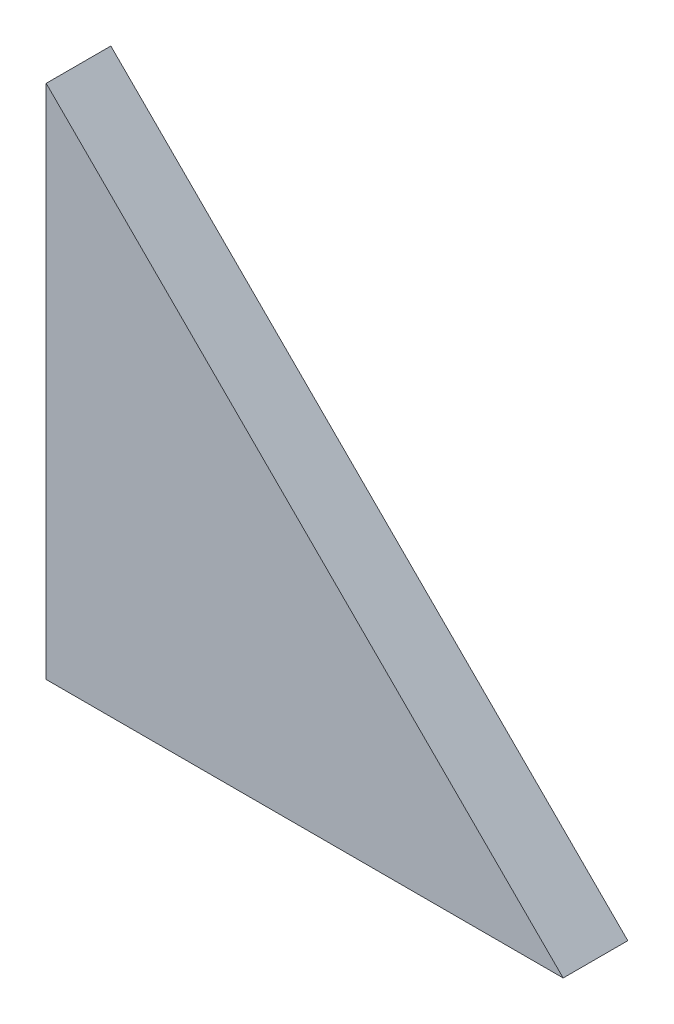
ISO-10303-21;
HEADER;
FILE_DESCRIPTION(('STEP AP214'),'2;1');
FILE_NAME('part.step','',(''),(''),'','','');
FILE_SCHEMA(('AUTOMOTIVE_DESIGN { 1 0 10303 214 1 1 1 1 }'));
ENDSEC;
DATA;
#1=APPLICATION_CONTEXT('core data for automotive mechanical design processes');
#2=APPLICATION_PROTOCOL_DEFINITION('international standard','automotive_design',2000,#1);
#3=PRODUCT_CONTEXT('',#1,'mechanical');
#4=PRODUCT('Part','Part','',(#3));
#5=PRODUCT_RELATED_PRODUCT_CATEGORY('part','',(#4));
#6=PRODUCT_DEFINITION_FORMATION('','',#4);
#7=PRODUCT_DEFINITION_CONTEXT('part definition',#1,'design');
#8=PRODUCT_DEFINITION('design','',#6,#7);
#9=PRODUCT_DEFINITION_SHAPE('','',#8);
#10=(LENGTH_UNIT() NAMED_UNIT(*) SI_UNIT(.MILLI.,.METRE.));
#11=(NAMED_UNIT(*) PLANE_ANGLE_UNIT() SI_UNIT($,.RADIAN.));
#12=(NAMED_UNIT(*) SI_UNIT($,.STERADIAN.) SOLID_ANGLE_UNIT());
#13=UNCERTAINTY_MEASURE_WITH_UNIT(LENGTH_MEASURE(1.E-05),#10,'distance_accuracy_value','');
#14=(GEOMETRIC_REPRESENTATION_CONTEXT(3) GLOBAL_UNCERTAINTY_ASSIGNED_CONTEXT((#13)) GLOBAL_UNIT_ASSIGNED_CONTEXT((#10,
#11,#12)) REPRESENTATION_CONTEXT('',''));
#15=CARTESIAN_POINT('',(0.,0.,0.));
#16=DIRECTION('',(0.,0.,1.));
#17=DIRECTION('',(1.,0.,0.));
#18=AXIS2_PLACEMENT_3D('',#15,#16,#17);
#19=CARTESIAN_POINT('',(101.6,0.,12.7));
#20=DIRECTION('',(0.,1.,0.));
#21=DIRECTION('',(-1.,0.,0.));
#22=AXIS2_PLACEMENT_3D('',#19,#20,#21);
#23=PLANE('',#22);
#24=DIRECTION('',(1.,0.,0.));
#25=VECTOR('',#24,1.);
#26=CARTESIAN_POINT('',(101.6,0.,0.));
#27=LINE('',#26,#25);
#28=CARTESIAN_POINT('',(0.,0.,0.));
#29=VERTEX_POINT('',#28);
#30=CARTESIAN_POINT('',(101.6,0.,0.));
#31=VERTEX_POINT('',#30);
#32=EDGE_CURVE('E78',#29,#31,#27,.T.);
#33=ORIENTED_EDGE('',*,*,#32,.T.);
#34=DIRECTION('',(0.,0.,-1.));
#35=VECTOR('',#34,1.);
#36=CARTESIAN_POINT('',(101.6,0.,12.7));
#37=LINE('',#36,#35);
#38=CARTESIAN_POINT('',(101.6,0.,12.7));
#39=VERTEX_POINT('',#38);
#40=EDGE_CURVE('E11',#39,#31,#37,.T.);
#41=ORIENTED_EDGE('',*,*,#40,.F.);
#42=DIRECTION('',(1.,0.,0.));
#43=VECTOR('',#42,1.);
#44=CARTESIAN_POINT('',(101.6,0.,12.7));
#45=LINE('',#44,#43);
#46=CARTESIAN_POINT('',(0.,0.,12.7));
#47=VERTEX_POINT('',#46);
#48=EDGE_CURVE('E71',#47,#39,#45,.T.);
#49=ORIENTED_EDGE('',*,*,#48,.F.);
#50=DIRECTION('',(0.,0.,-1.));
#51=VECTOR('',#50,1.);
#52=CARTESIAN_POINT('',(0.,0.,12.7));
#53=LINE('',#52,#51);
#54=EDGE_CURVE('E79',#47,#29,#53,.T.);
#55=ORIENTED_EDGE('',*,*,#54,.T.);
#56=EDGE_LOOP('',(#33,#41,#49,#55));
#57=FACE_BOUND('',#56,.T.);
#58=ADVANCED_FACE('F31',(#57),#23,.F.);
#59=CARTESIAN_POINT('',(0.,101.476236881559,12.7));
#60=DIRECTION('',(-0.706675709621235,-0.707537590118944,0.));
#61=DIRECTION('',(0.707537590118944,-0.706675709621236,0.));
#62=AXIS2_PLACEMENT_3D('',#59,#60,#61);
#63=PLANE('',#62);
#64=DIRECTION('',(-0.707537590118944,0.706675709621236,0.));
#65=VECTOR('',#64,1.);
#66=CARTESIAN_POINT('',(0.,101.476236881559,0.));
#67=LINE('',#66,#65);
#68=CARTESIAN_POINT('',(0.,101.476236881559,0.));
#69=VERTEX_POINT('',#68);
#70=EDGE_CURVE('E59',#31,#69,#67,.T.);
#71=ORIENTED_EDGE('',*,*,#70,.T.);
#72=DIRECTION('',(0.,0.,-1.));
#73=VECTOR('',#72,1.);
#74=CARTESIAN_POINT('',(0.,101.476236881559,12.7));
#75=LINE('',#74,#73);
#76=CARTESIAN_POINT('',(0.,101.476236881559,12.7));
#77=VERTEX_POINT('',#76);
#78=EDGE_CURVE('E39',#77,#69,#75,.T.);
#79=ORIENTED_EDGE('',*,*,#78,.F.);
#80=DIRECTION('',(-0.707537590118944,0.706675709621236,0.));
#81=VECTOR('',#80,1.);
#82=CARTESIAN_POINT('',(0.,101.476236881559,12.7));
#83=LINE('',#82,#81);
#84=EDGE_CURVE('E67',#39,#77,#83,.T.);
#85=ORIENTED_EDGE('',*,*,#84,.F.);
#86=ORIENTED_EDGE('',*,*,#40,.T.);
#87=EDGE_LOOP('',(#71,#79,#85,#86));
#88=FACE_BOUND('',#87,.T.);
#89=ADVANCED_FACE('F68',(#88),#63,.F.);
#90=CARTESIAN_POINT('',(0.,0.,12.7));
#91=DIRECTION('',(1.,0.,0.));
#92=DIRECTION('',(0.,0.,-1.));
#93=AXIS2_PLACEMENT_3D('',#90,#91,#92);
#94=PLANE('',#93);
#95=DIRECTION('',(0.,-1.,0.));
#96=VECTOR('',#95,1.);
#97=CARTESIAN_POINT('',(0.,0.,0.));
#98=LINE('',#97,#96);
#99=EDGE_CURVE('E64',#69,#29,#98,.T.);
#100=ORIENTED_EDGE('',*,*,#99,.T.);
#101=ORIENTED_EDGE('',*,*,#54,.F.);
#102=DIRECTION('',(0.,-1.,0.));
#103=VECTOR('',#102,1.);
#104=CARTESIAN_POINT('',(0.,0.,12.7));
#105=LINE('',#104,#103);
#106=EDGE_CURVE('E47',#77,#47,#105,.T.);
#107=ORIENTED_EDGE('',*,*,#106,.F.);
#108=ORIENTED_EDGE('',*,*,#78,.T.);
#109=EDGE_LOOP('',(#100,#101,#107,#108));
#110=FACE_BOUND('',#109,.T.);
#111=ADVANCED_FACE('F86',(#110),#94,.F.);
#112=CARTESIAN_POINT('',(0.,0.,12.7));
#113=DIRECTION('',(0.,0.,-1.));
#114=DIRECTION('',(-1.,0.,0.));
#115=AXIS2_PLACEMENT_3D('',#112,#113,#114);
#116=PLANE('',#115);
#117=ORIENTED_EDGE('',*,*,#48,.T.);
#118=ORIENTED_EDGE('',*,*,#84,.T.);
#119=ORIENTED_EDGE('',*,*,#106,.T.);
#120=EDGE_LOOP('',(#117,#118,#119));
#121=FACE_BOUND('',#120,.T.);
#122=ADVANCED_FACE('F74',(#121),#116,.F.);
#123=CARTESIAN_POINT('',(0.,0.,0.));
#124=DIRECTION('',(0.,0.,-1.));
#125=DIRECTION('',(-1.,0.,0.));
#126=AXIS2_PLACEMENT_3D('',#123,#124,#125);
#127=PLANE('',#126);
#128=ORIENTED_EDGE('',*,*,#32,.F.);
#129=ORIENTED_EDGE('',*,*,#99,.F.);
#130=ORIENTED_EDGE('',*,*,#70,.F.);
#131=EDGE_LOOP('',(#128,#129,#130));
#132=FACE_BOUND('',#131,.T.);
#133=ADVANCED_FACE('F87',(#132),#127,.T.);
#134=CLOSED_SHELL('',(#58,#89,#111,#122,#133));
#135=MANIFOLD_SOLID_BREP('B2',#134);
#136=ADVANCED_BREP_SHAPE_REPRESENTATION('',(#18,#135),#14);
#137=SHAPE_DEFINITION_REPRESENTATION(#9,#136);
ENDSEC;
END-ISO-10303-21;
